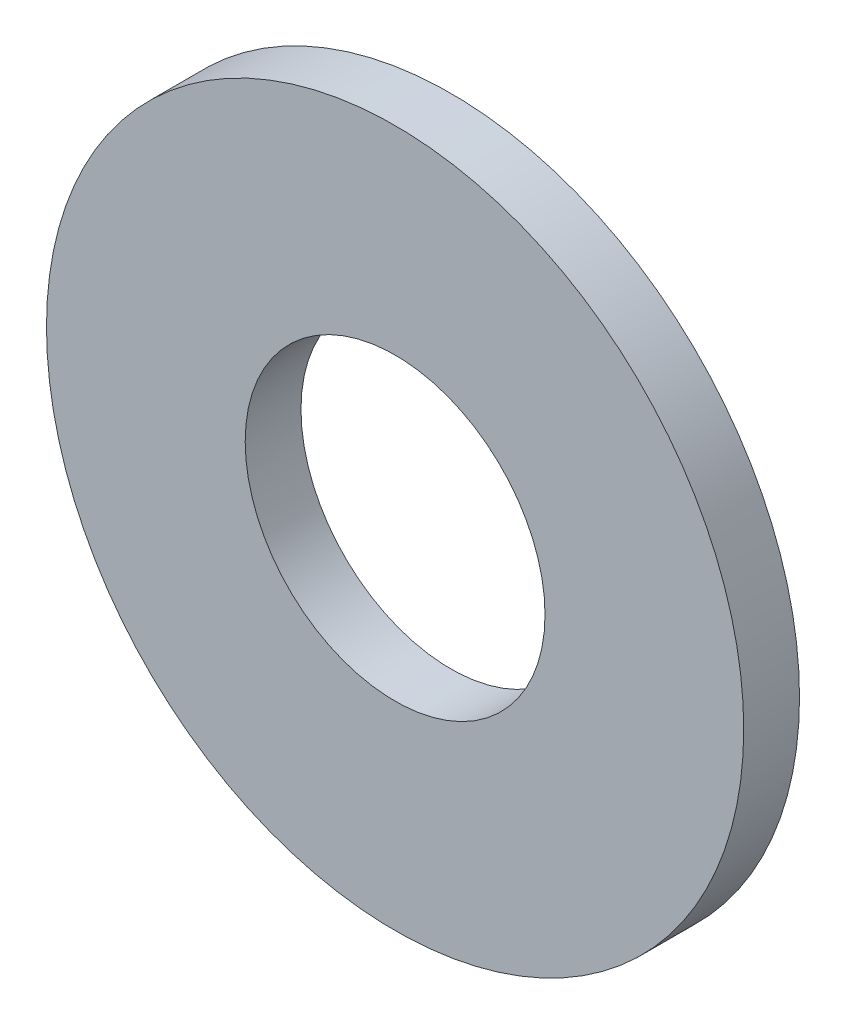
from build123d import *

# Parameters (mm, degrees)
ESQUISSE1_R      = 5
ESQUISSE1_R_2    = 2.15
EXTRUSION1_DEPTH = 0.8


with BuildPart() as part:
    # Esquisse1 → Extrusion1 (new body)
    with BuildSketch(Plane.XY):
        Circle(ESQUISSE1_R)
        Circle(ESQUISSE1_R_2, mode=Mode.SUBTRACT)
    extrude(amount=EXTRUSION1_DEPTH)


solid = part.part
